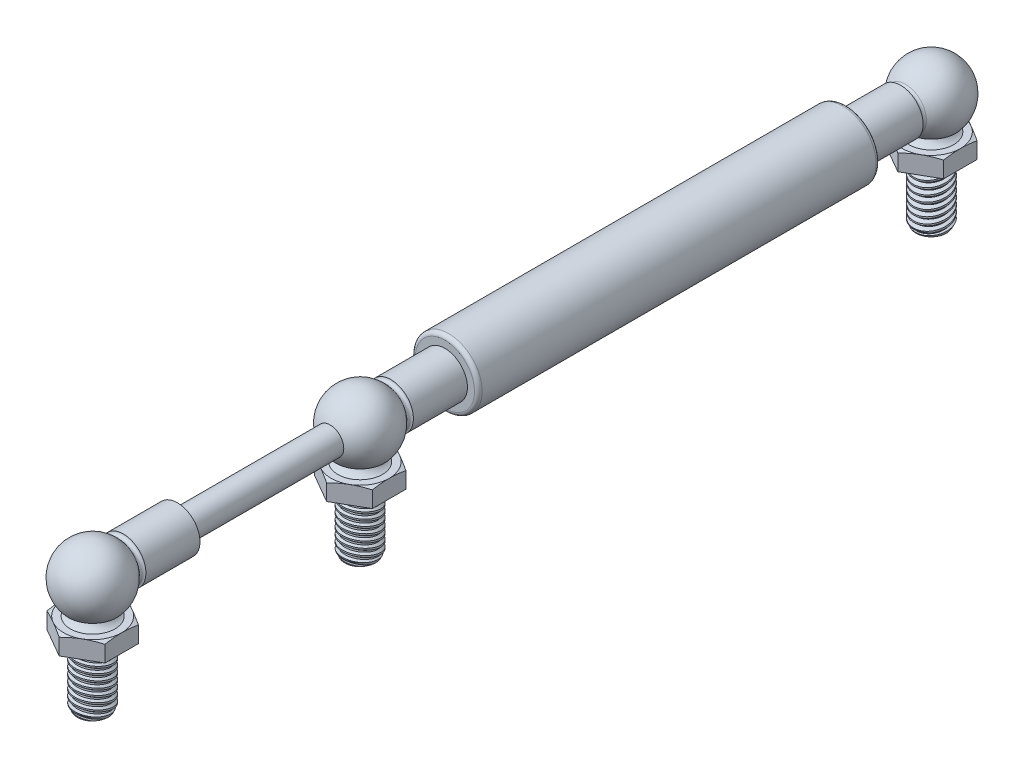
from build123d import *
from build123d.topology import SkipClean

# Parameters (mm, degrees)
FILLET2_R           = 0.8589999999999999
EXTRUDE1_DEPTH      = 4
SKETCH6_OUTSIDE_W   = 611.438
SKETCH6_OUTSIDE_H   = 712.974
SKETCH6_OUTSIDE_R   = 6.500000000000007
CUT_EXTRUDE2_DEPTH  = 103.85017524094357
CUT_EXTRUDE2_DRAFT  = -70.00000000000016
LPATTERN1_COUNT     = 10
LPATTERN1_PITCH     = 1.411111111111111
LPATTERN1_COL_COUNT = 2
LPATTERN1_COL_PITCH = 1.411111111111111
LPATTERN2_COUNT     = 2
LPATTERN2_PITCH     = 59.943999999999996


with BuildPart() as part:
    # Sketch1 → Revolve1 (revolve)
    with BuildSketch(Plane(origin=(0, 0, 0), x_dir=(0, 0, -1), z_dir=(1, 0, 0)), mode=Mode.PRIVATE) as revolve1_sk:
        Polygon((74.97999999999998, 0), (74.97999999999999, 7.492999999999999), (-15.035999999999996, 7.492999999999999), (-15.035999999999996, 3.198), (44.908, 3.198), (64.908, 3.1980000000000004), (64.908, 0), align=None)
    revolve(revolve1_sk.sketch.rotate(Axis((0, 0, 93.97999999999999), (0, 0, -1)), 90), axis=Axis((0, 0, 93.97999999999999), (0, 0, -1)))

    # Fillet2
    fillet2_edges = [part.edges().sort_by_distance(p)[0] for p in [
        (-7.492999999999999, -1.75e-15, 15.036000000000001),
        (-7.492999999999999, -1.75e-15, -74.97999999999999),
    ]]
    fillet(fillet2_edges, radius=FILLET2_R)


with BuildPart() as body_2:
    # Sketch2 → Revolve2 (revolve)
    with BuildSketch(Plane(origin=(0, 0, 0), x_dir=(0, 0, -1), z_dir=(1, 0, 0))):
        with BuildLine():
            Line((74.97999999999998, 5.049999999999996), (87.09530200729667, 5.049999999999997))
            ThreePointArc((87.09530200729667, 5.049999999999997), (87.51865036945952, 4.451310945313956), (88.22421093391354, 4.650902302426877))
            ThreePointArc((88.22421093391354, 4.650902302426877), (96.44649152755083, 6.976848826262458), (101.38, 0))
            Line((101.38, 0), (99.07999999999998, 0))
            ThreePointArc((99.07999999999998, 0), (93.97999999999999, 5.099999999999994), (88.88, 0))
            Line((88.88, 0), (74.97999999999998, -3.48e-15))
            Line((74.97999999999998, -3.48e-15), (74.97999999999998, 5.049999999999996))
        make_face()
    revolve(axis=Axis((0, -3.48e-15, -74.97999999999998), (0, -1.2e-16, 1)))

    # Sketch3 → Cut-Revolve1 (revolve, cut)
    with SkipClean():  # the faces are left unmerged after this step: merging them gives an invalid solid
        with BuildSketch(Plane(origin=(0, 0, 0), x_dir=(0, 0, -1), z_dir=(1, 0, 0))):
            Polygon((99.07999999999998, -5.050000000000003), (99.38902024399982, -5.0500000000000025), (99.38902024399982, -7.400000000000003), (93.97999999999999, -7.400000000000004), (93.97999999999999, 0), (99.07999999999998, -3.48e-15), align=None)
        revolve(axis=Axis((0, 0, -93.97999999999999), (0, 1, -2.72e-15)), mode=Mode.SUBTRACT)


with BuildPart() as body_3:
    # Sketch4 → Revolve3 (revolve)
    with BuildSketch(Plane(origin=(0, 0, 0), x_dir=(0, 0, -1), z_dir=(1, 0, 0))):
        with BuildLine():
            Line((93.98, 4.534838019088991), (93.97999999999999, -11.429999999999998))
            Line((93.97999999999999, -11.429999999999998), (100.48, -11.429999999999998))
            Line((100.48, -11.429999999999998), (100.48000000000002, -7.429999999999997))
            Line((100.48000000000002, -7.429999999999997), (98.98000000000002, -7.429999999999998))
            ThreePointArc((98.98000000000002, -7.429999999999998), (97.38886493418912, -5.4421794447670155), (97.94875, -2.9582973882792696))
            ThreePointArc((97.94875, -2.9582973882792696), (98.7650489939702, 1.2672040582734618), (95.964375, 4.534838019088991))
            Line((95.964375, 4.534838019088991), (93.98, 4.534838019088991))
        make_face()
    revolve(axis=Axis((0, -25.4, -93.97999999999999), (0, -1, 0)))

    # Sketch5 → Extrude1 (add)
    with BuildSketch(Plane.XZ.offset(11.429999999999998)):
        Polygon((1.73e-15, -101.48555349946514), (6.5000000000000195, -97.73277674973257), (6.5000000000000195, -90.22722325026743), (7.74e-15, -86.47444650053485), (-6.499999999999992, -90.22722325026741), (-6.499999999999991, -97.7327767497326), align=None)
    extrude(amount=-EXTRUDE1_DEPTH)


with BuildPart() as cut_extrude2_tool:
    # Sketch6 outside → Cut-Extrude2 (with draft: the straight prism first)
    with BuildSketch(Plane(origin=(0, -7.429999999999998, 0), x_dir=(-1, 0, 0), z_dir=(0, 1, 0))):
        with Locations((0, -43.22500000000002)):
            Rectangle(SKETCH6_OUTSIDE_W, SKETCH6_OUTSIDE_H)
        with Locations((0, -93.97999999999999)):
            Circle(SKETCH6_OUTSIDE_R, mode=Mode.SUBTRACT)
    extrude(amount=-CUT_EXTRUDE2_DEPTH)
    # Cut-Extrude2: the draft: its side faces are tilted about the plane it starts from
    cut_extrude2_sides = [cut_extrude2_tool.faces().sort_by_distance(p)[0] for p in [
        (0, -59.35508762, -399.712),
        (-305.719, -59.35508762, -43.225),
        (0, -59.35508762, 313.262),
        (305.719, -59.35508762, -43.225),
        (6.5, -59.35508762, -93.98),
    ]]
    draft(cut_extrude2_sides, Plane(origin=(0, -7.429999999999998, 0), x_dir=(-1, 0, 0), z_dir=(0, 1, 0)), CUT_EXTRUDE2_DRAFT)


with BuildPart() as body_3_1:
    add(body_3.part)

    # Cut-Extrude2: cut by cut_extrude2_tool
    add(cut_extrude2_tool.part, mode=Mode.SUBTRACT)


with BuildPart() as body_4:
    # Sketch7 → Revolve4 (revolve)
    with BuildSketch(Plane(origin=(0, 0, 0), x_dir=(0, 0, -1), z_dir=(1, 0, 0)), mode=Mode.PRIVATE) as revolve4_sk:
        Polygon((93.97999999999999, -11.429999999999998), (97.94875, -11.429999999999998), (97.94875, -24.253635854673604), (97.41419162, -25.4), (93.97999999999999, -25.4), align=None)
    revolve(revolve4_sk.sketch.rotate(Axis((0, -25.4, -93.97999999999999), (0, -1, 0)), 180), axis=Axis((0, -25.4, -93.97999999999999), (0, -1, 0)))

    # Sketch8 → Cut-Revolve2 (revolve, cut)
    with BuildSketch(Plane(origin=(0, 0, 0), x_dir=(0, 0, -1), z_dir=(1, 0, 0)), mode=Mode.PRIVATE) as cut_revolve2_sk:
        Polygon((97.97962393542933, -11.603665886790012), (98.19574148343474, -12.819327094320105), (97.36656129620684, -12.518850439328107), (97.30481342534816, -12.171518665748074), align=None)
    cut_revolve2 = revolve(cut_revolve2_sk.sketch.rotate(Axis((0, -11.430000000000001, -93.71124423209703), (0, -0.9845625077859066, -0.1750333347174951)), 180), axis=Axis((0, -11.430000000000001, -93.71124423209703), (0, -0.9845625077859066, -0.1750333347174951)), mode=Mode.SUBTRACT)

    # LPattern1: Cut-Revolve2 ×10
    with Locations(*[(0, -i * LPATTERN1_PITCH, 0) for i in range(1, LPATTERN1_COUNT)]):
        add(cut_revolve2, mode=Mode.SUBTRACT)

    # LPattern1 col: Cut-Revolve2 ×2
    with Locations(*[(0, i * LPATTERN1_COL_PITCH, 0) for i in range(1, LPATTERN1_COL_COUNT)]):
        add(cut_revolve2, mode=Mode.SUBTRACT)

    # Combine1: union body 3
    add(body_3_1.part)


with BuildPart() as body_4_2:
    # Sketch9 → Revolve5 (revolve)
    with BuildSketch(Plane(origin=(0, 0, 0), x_dir=(0, 0, -1), z_dir=(1, 0, 0)), mode=Mode.PRIVATE) as revolve5_sk:
        Polygon((-74.97999999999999, 0), (-74.97999999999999, 3.048), (4.9640000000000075, 3.048), (4.9640000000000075, 9.54e-15), align=None)
    revolve(revolve5_sk.sketch.rotate(Axis((0, 0, 74.97999999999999), (0, 0, 1)), 90), axis=Axis((0, 0, 74.97999999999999), (0, 0, 1)))


with BuildPart() as body_5:
    # Mirror2: mirrored copy
    add(body_4.part.mirror(Plane.XY))


with BuildPart() as body_6:
    # Mirror2 2: mirrored copy
    add(body_2.part.mirror(Plane.XY))

    # Combine2: union body 4 2
    add(body_4_2.part)


with BuildPart() as body_2_1:
    add(body_2.part)

    # Combine3: union part
    add(part.part)


with BuildPart() as lpattern2_1:
    # LPattern2: pattern copy
    add(body_5.part.moved(Location(Vector(0, -6e-17, -1) * (1 * LPATTERN2_PITCH))))


with BuildPart() as lpattern2_2:
    # LPattern2: pattern copy
    add(body_6.part.moved(Location(Vector(0, -6e-17, -1) * (1 * LPATTERN2_PITCH))))


solid = Compound([body_4.part, body_5.part, body_6.part, body_2_1.part, lpattern2_1.part, lpattern2_2.part])
